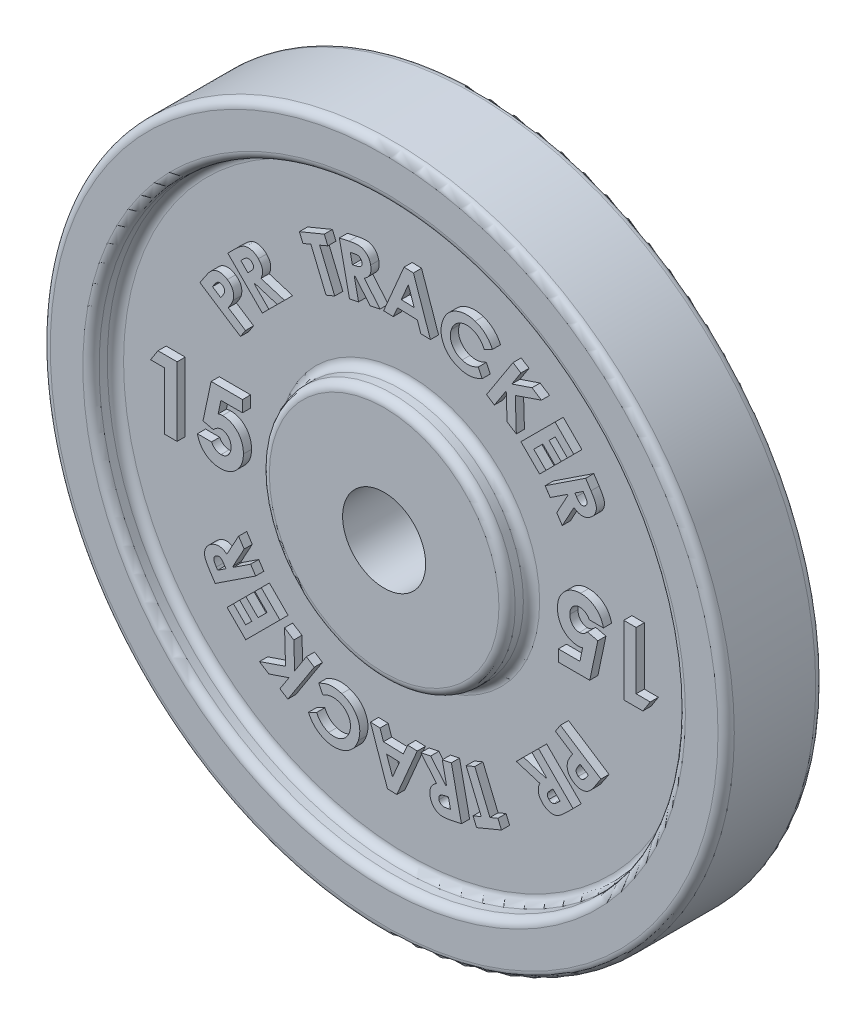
from build123d import *

# Parameters (mm, degrees)
ESBO_O1_R                = 21
ESBO_O1_R_2              = 2.55
RESSALTO_EXTRUS_O1_DEPTH = 6
ESBO_O2_R                = 18
ESBO_O2_R_2              = 7.55
CORTE_EXTRUS_O1_DEPTH    = 1.5
FILETE1_R                = 0.5
RESSALTO_EXTRUS_O2_DEPTH = 0.5
RESSALTO_EXTRUS_O3_DEPTH = 0.5
PADR_OCIRCULAR1_COUNT    = 2
FILETE2_R                = 0.5
FILETE3_R                = 0.5
RESSALTO_EXTRUS_O4_DEPTH = 0.5
RESSALTO_EXTRUS_O5_DEPTH = 0.5
PADR_OCIRCULAR2_COUNT    = 2


with BuildPart() as part:
    # Esbo_o1 → Ressalto-extrus_o1 (new body)
    with BuildSketch(Plane.XY):
        Circle(ESBO_O1_R)
        Circle(ESBO_O1_R_2, mode=Mode.SUBTRACT)
    extrude(amount=RESSALTO_EXTRUS_O1_DEPTH)

    # Esbo_o2 → Corte-extrus_o1 (cut)
    with BuildSketch(Plane.XY.offset(6)):
        Circle(ESBO_O2_R)
        Circle(ESBO_O2_R_2, mode=Mode.SUBTRACT)
    corte_extrus_o1 = extrude(amount=-CORTE_EXTRUS_O1_DEPTH, mode=Mode.SUBTRACT)

    # Filete1
    filete1_edges = [part.edges().sort_by_distance(p)[0] for p in [
        (-7.55, 0, 6),
        (-18, 0, 4.5),
        (-7.55, 0, 4.5),
        (-18, 0, 6),
    ]]
    fillet(filete1_edges, radius=FILETE1_R)

    # Esbo_o3 → Ressalto-extrus_o2 (add)
    # profile 1 of 9: a face of its own
    with BuildSketch(Plane.XY.offset(4.5)):
        with BuildLine():
            Line((11.372106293, 8.482696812), (11.70263514, 7.980893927))
            add(Edge.make_bspline(
                [(11.70263514, 7.980893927), (11.724196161, 7.947521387), (11.76576219, 7.883184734), (11.823642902, 7.789141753), (11.873676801, 7.700688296), (11.916269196, 7.618168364), (11.9531268, 7.542072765), (11.980870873, 7.471076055), (12.003586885, 7.406664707), (12.021625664, 7.328534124), (12.03179376, 7.234371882), (12.026669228, 7.122080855), (12.001764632, 7.010507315), (11.967025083, 6.919591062), (11.931859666, 6.848115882), (11.899674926, 6.79663945), (11.864071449, 6.746943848), (11.824230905, 6.699405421), (11.780243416, 6.653640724), (11.732185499, 6.609991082), (11.680364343, 6.567911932), (11.642951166, 6.542901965), (11.623909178, 6.530172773)],
                knots=[0, 0, 0, 0, 1.424579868, 2.746350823, 3.958867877, 5.067175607, 6.076040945, 6.988342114, 7.799210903, 8.522229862, 9.85875015, 11.181925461, 12.534388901, 13.939130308, 14.6618638, 15.387446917, 16.113030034, 16.852417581, 17.609320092, 18.387197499, 19.179140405, 20, 20, 20, 20], degree=3))
            add(Edge.make_bspline(
                [(11.623909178, 6.530172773), (11.603651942, 6.517253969), (11.563893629, 6.491898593), (11.502471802, 6.459700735), (11.441435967, 6.4320533), (11.380132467, 6.410855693), (11.319315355, 6.393320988), (11.258225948, 6.382908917), (11.197384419, 6.37656645), (11.136436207, 6.37605724), (11.075684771, 6.380787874), (11.01502661, 6.391326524), (10.954290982, 6.40654737), (10.894169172, 6.429160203), (10.833127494, 6.454272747), (10.77304555, 6.486804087), (10.712688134, 6.523926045), (10.673802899, 6.552333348), (10.653957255, 6.566831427)],
                knots=[0, 0, 0, 0, 1.102086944, 2.163035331, 3.179481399, 4.173821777, 5.137300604, 6.080390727, 7.013391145, 7.941897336, 8.873265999, 9.805722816, 10.76445368, 11.741476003, 12.750579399, 13.790977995, 14.872593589, 16, 16, 16, 16], degree=3))
            Line((10.653957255, 6.566831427), (9.936409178, 5.250124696))
            Line((9.936409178, 5.250124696), (9.595663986, 5.766951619))
            Line((9.595663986, 5.766951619), (10.279558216, 7.020557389))
            Line((10.279558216, 7.020557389), (10.250712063, 7.065028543))
            Line((10.250712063, 7.065028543), (9.197827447, 6.370917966))
            Line((9.197827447, 6.370917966), (8.885928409, 6.843874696))
            Line((8.885928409, 6.843874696), (11.372106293, 8.482696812))
        make_face()
        with BuildLine():
            Line((10.712250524, 7.369115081), (10.810207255, 7.220076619))
            add(Edge.make_bspline(
                [(10.810207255, 7.220076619), (10.82222925, 7.201908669), (10.845308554, 7.167030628), (10.881668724, 7.119046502), (10.916195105, 7.076232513), (10.949997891, 7.039374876), (10.982453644, 7.008009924), (11.013544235, 6.981619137), (11.044400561, 6.961738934), (11.083194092, 6.942255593), (11.134321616, 6.929880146), (11.19829258, 6.932687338), (11.264419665, 6.953846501), (11.305669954, 6.978554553), (11.32763514, 6.991711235)],
                knots=[0, 0, 0, 0, 1.203101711, 2.309662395, 3.324143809, 4.240453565, 5.070005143, 5.816667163, 6.488851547, 7.092611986, 8.2090873, 9.349703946, 10.588755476, 12, 12, 12, 12], degree=3))
            add(Edge.make_bspline(
                [(11.32763514, 6.991711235), (11.340342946, 7.000767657), (11.365409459, 7.01863171), (11.397276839, 7.051005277), (11.422317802, 7.087453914), (11.441728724, 7.126408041), (11.454266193, 7.167891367), (11.460187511, 7.210446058), (11.460451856, 7.253814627), (11.452661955, 7.300191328), (11.434169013, 7.353004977), (11.403911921, 7.416123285), (11.360818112, 7.491805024), (11.326138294, 7.545387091), (11.307202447, 7.574643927)],
                knots=[0, 0, 0, 0, 0.842179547, 1.661223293, 2.4389524, 3.223208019, 4.003944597, 4.769372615, 5.537932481, 6.338747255, 7.29721474, 8.551489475, 10.117047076, 12, 12, 12, 12], degree=3))
            Line((11.307202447, 7.574643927), (11.221264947, 7.705052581))
            Line((11.221264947, 7.705052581), (10.712250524, 7.369115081))
        make_face(mode=Mode.SUBTRACT)
    # profile 2 of 9: a face of its own
    with BuildSketch(Plane.XY.offset(4.5)):
        Polygon((9.497131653, 10.539133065), (10.643766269, 9.392498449), (10.252540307, 9.001272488), (9.503141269, 9.750671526), (9.123333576, 9.370863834), (9.872732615, 8.621464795), (9.488718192, 8.237450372), (8.739319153, 8.986849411), (8.187035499, 8.434565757), (8.936434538, 7.685166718), (8.544006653, 7.292738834), (7.397372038, 8.439373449), align=None)
    # profile 3 of 9: a face of its own
    with BuildSketch(Plane.XY.offset(4.5)):
        Polygon((6.914354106, 12.404591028), (7.398128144, 12.092091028), (6.838632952, 11.227307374), (8.080219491, 11.650384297), (8.655940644, 11.277788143), (7.053176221, 10.72550449), (7.11507526, 8.709278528), (6.547767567, 9.075865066), (6.494281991, 10.69425449), (5.771926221, 9.578268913), (5.288152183, 9.890768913), align=None)
    # profile 4 of 9: a face of its own
    with BuildSketch(Plane.XY.offset(4.5)):
        with BuildLine():
            Line((5.643245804, 12.465489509), (5.14564965, 12.22750874))
            add(Edge.make_bspline(
                [(5.14564965, 12.22750874), (5.124240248, 12.270637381), (5.08238287, 12.354957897), (5.00706436, 12.470935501), (4.925885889, 12.576147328), (4.8364413, 12.668755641), (4.740854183, 12.750845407), (4.636864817, 12.819650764), (4.526124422, 12.877448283), (4.447693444, 12.906043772), (4.408269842, 12.920417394)],
                knots=[0, 0, 0, 0, 1.108720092, 2.167651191, 3.18060078, 4.166538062, 5.129360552, 6.078037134, 7.033918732, 8, 8, 8, 8], degree=3))
            add(Edge.make_bspline(
                [(4.408269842, 12.920417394), (4.374572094, 12.930426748), (4.308244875, 12.950128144), (4.20743273, 12.969055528), (4.107941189, 12.976362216), (4.009462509, 12.975892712), (3.912242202, 12.963380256), (3.815944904, 12.941789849), (3.72111022, 12.909667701), (3.628914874, 12.867530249), (3.540271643, 12.818525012), (3.458639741, 12.760702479), (3.383840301, 12.69679356), (3.317503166, 12.624839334), (3.257358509, 12.547286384), (3.205773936, 12.461756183), (3.160882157, 12.369669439), (3.137626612, 12.304480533), (3.125817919, 12.271378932)],
                knots=[0, 0, 0, 0, 1.052060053, 2.070767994, 3.063437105, 4.035120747, 5.014106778, 5.991861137, 6.985689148, 8.005720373, 9.023421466, 10.013478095, 10.995783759, 11.96331235, 12.938580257, 13.929127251, 14.948452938, 16, 16, 16, 16], degree=3))
            add(Edge.make_bspline(
                [(3.125817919, 12.271378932), (3.118498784, 12.247826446), (3.104097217, 12.201483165), (3.088054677, 12.131334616), (3.075938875, 12.062137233), (3.067945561, 11.993527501), (3.06487748, 11.925441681), (3.066897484, 11.858001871), (3.072609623, 11.791291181), (3.083667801, 11.725686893), (3.098584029, 11.661415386), (3.117746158, 11.598917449), (3.141327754, 11.538489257), (3.169232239, 11.47995944), (3.200812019, 11.422929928), (3.237072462, 11.368310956), (3.277089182, 11.31540859), (3.321216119, 11.264964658), (3.368772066, 11.216562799), (3.419521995, 11.171968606), (3.473001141, 11.130439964), (3.529513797, 11.092992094), (3.588517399, 11.057556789), (3.650877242, 11.026911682), (3.715625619, 10.998527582), (3.760506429, 10.983385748), (3.783269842, 10.975705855)],
                knots=[0, 0, 0, 0, 1.08983963, 2.1444336, 3.178001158, 4.193971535, 5.19552419, 6.187598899, 7.174443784, 8.152670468, 9.125633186, 10.089121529, 11.039541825, 11.990127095, 12.953371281, 13.918526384, 14.88546701, 15.883372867, 16.878918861, 17.882661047, 18.867398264, 19.869381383, 20.877721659, 21.907298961, 22.938588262, 24, 24, 24, 24], degree=3))
            add(Edge.make_bspline(
                [(3.783269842, 10.975705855), (3.82212513, 10.96407343), (3.898580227, 10.941184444), (4.015139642, 10.921347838), (4.130158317, 10.915055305), (4.225424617, 10.918680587), (4.301950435, 10.930417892), (4.362185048, 10.942341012), (4.425160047, 10.95866318), (4.490718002, 10.979184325), (4.558828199, 11.004016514), (4.62946354, 11.032959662), (4.703130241, 11.065380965), (4.752502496, 11.089513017), (4.777861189, 11.101907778)],
                knots=[0, 0, 0, 0, 1.412340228, 2.779045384, 4.10748043, 5.421237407, 6.091506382, 6.803337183, 7.560088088, 8.35707087, 9.196132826, 10.085318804, 11.016576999, 12, 12, 12, 12], degree=3))
            Line((4.777861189, 11.101907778), (5.020048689, 10.599503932))
            add(Edge.make_bspline(
                [(5.020048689, 10.599503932), (4.986137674, 10.582965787), (4.91971388, 10.550571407), (4.819970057, 10.508372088), (4.723678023, 10.470788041), (4.630302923, 10.438698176), (4.539814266, 10.412426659), (4.452316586, 10.390824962), (4.367745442, 10.376061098), (4.285510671, 10.365955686), (4.204189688, 10.362076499), (4.122362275, 10.362044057), (4.039098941, 10.366209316), (3.95461992, 10.375168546), (3.868879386, 10.389396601), (3.781937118, 10.407109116), (3.69381468, 10.430250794), (3.635166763, 10.448440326), (3.605385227, 10.457677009)],
                knots=[0, 0, 0, 0, 1.235616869, 2.420286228, 3.546204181, 4.621062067, 5.653067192, 6.631820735, 7.5714333, 8.463446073, 9.343896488, 10.236271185, 11.14293321, 12.073336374, 13.017223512, 13.98880256, 14.978709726, 16, 16, 16, 16], degree=3))
            add(Edge.make_bspline(
                [(3.605385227, 10.457677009), (3.551727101, 10.476565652), (3.446398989, 10.513643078), (3.297649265, 10.584292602), (3.161014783, 10.665870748), (3.035742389, 10.757492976), (2.922155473, 10.860013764), (2.820622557, 10.973645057), (2.731387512, 11.098072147), (2.654896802, 11.231948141), (2.591081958, 11.372150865), (2.543576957, 11.517568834), (2.51058845, 11.665663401), (2.494729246, 11.817233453), (2.49340558, 11.971430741), (2.508187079, 12.128829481), (2.538861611, 12.289174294), (2.570587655, 12.395221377), (2.586755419, 12.449263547)],
                knots=[0, 0, 0, 0, 1.087256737, 2.134228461, 3.142668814, 4.126448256, 5.097398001, 6.063225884, 7.034900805, 8.019872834, 9.007433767, 9.975333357, 10.94012752, 11.903376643, 12.884071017, 13.884292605, 14.921823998, 16, 16, 16, 16], degree=3))
            add(Edge.make_bspline(
                [(2.586755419, 12.449263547), (2.598710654, 12.484095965), (2.622351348, 12.552974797), (2.665512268, 12.65208616), (2.712703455, 12.746597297), (2.765297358, 12.83581344), (2.822358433, 12.920395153), (2.885131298, 12.999649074), (2.952295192, 13.074640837), (3.025439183, 13.143444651), (3.102079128, 13.208027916), (3.183365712, 13.26630797), (3.268736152, 13.318674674), (3.357150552, 13.366279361), (3.450083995, 13.4073008), (3.546606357, 13.442756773), (3.647299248, 13.471979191), (3.750740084, 13.496147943), (3.856160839, 13.5133832), (3.962121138, 13.524247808), (4.067899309, 13.528599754), (4.173333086, 13.525669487), (4.278030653, 13.51504725), (4.38247792, 13.499035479), (4.486764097, 13.475736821), (4.555235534, 13.454541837), (4.589760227, 13.443854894)],
                knots=[0, 0, 0, 0, 1.061962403, 2.099961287, 3.115586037, 4.107642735, 5.085323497, 6.056407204, 7.021973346, 7.986605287, 8.950665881, 9.911273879, 10.868678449, 11.838127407, 12.805645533, 13.796506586, 14.802219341, 15.828295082, 16.859046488, 17.881389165, 18.899230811, 19.910902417, 20.921170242, 21.932973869, 22.95776332, 24, 24, 24, 24], degree=3))
            add(Edge.make_bspline(
                [(4.589760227, 13.443854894), (4.618936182, 13.433780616), (4.676886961, 13.413770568), (4.761345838, 13.377748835), (4.843666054, 13.338236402), (4.923879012, 13.294368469), (5.001343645, 13.245522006), (5.076553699, 13.192561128), (5.149572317, 13.135420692), (5.219496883, 13.073515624), (5.286779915, 13.008408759), (5.349692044, 12.939580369), (5.409691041, 12.868696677), (5.464914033, 12.794246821), (5.515403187, 12.716290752), (5.562227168, 12.635625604), (5.605999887, 12.552367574), (5.630803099, 12.494512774), (5.643245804, 12.465489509)],
                knots=[0, 0, 0, 0, 0.998866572, 1.984000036, 2.970072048, 3.953860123, 4.941572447, 5.932833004, 6.93037271, 7.941144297, 8.954553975, 9.959547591, 10.958329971, 11.959530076, 12.957722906, 13.963113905, 14.978181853, 16, 16, 16, 16], degree=3))
        make_face()
    # profile 5 of 9: a face of its own
    with BuildSketch(Plane.XY.offset(4.5)):
        Polygon((0.221709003, 14.132780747), (0.798031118, 14.112949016), (1.841300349, 11.088910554), (1.251156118, 11.109343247), (1.039617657, 11.732540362), (-0.177329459, 11.775208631), (-0.442353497, 11.168838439), (-1.03309869, 11.189271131), align=None)
        Polygon((0.48613208, 13.331098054), (0.05283881, 12.320881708), (0.84550708, 12.293237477), align=None, mode=Mode.SUBTRACT)
    # profile 6 of 9: a face of its own
    with BuildSketch(Plane.XY.offset(4.5)):
        with BuildLine():
            Line((-3.748977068, 13.699248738), (-3.157630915, 13.825450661))
            add(Edge.make_bspline(
                [(-3.157630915, 13.825450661), (-3.11861599, 13.833511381), (-3.043380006, 13.849055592), (-2.934083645, 13.867484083), (-2.832907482, 13.882026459), (-2.739971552, 13.892808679), (-2.655085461, 13.897468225), (-2.578472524, 13.898277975), (-2.509931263, 13.895221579), (-2.448440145, 13.886614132), (-2.392018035, 13.873700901), (-2.338344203, 13.856855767), (-2.286494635, 13.835739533), (-2.236425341, 13.810444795), (-2.18841238, 13.780791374), (-2.141582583, 13.747562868), (-2.096919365, 13.709826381), (-2.054116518, 13.66827923), (-2.014059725, 13.623221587), (-1.976360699, 13.575329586), (-1.943582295, 13.523161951), (-1.91349983, 13.46837792), (-1.886135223, 13.410817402), (-1.863720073, 13.349652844), (-1.843355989, 13.285833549), (-1.833382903, 13.241604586), (-1.828303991, 13.219080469)],
                knots=[0, 0, 0, 0, 1.704973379, 3.287853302, 4.742851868, 6.079738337, 7.290568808, 8.379457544, 9.358207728, 10.223935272, 11.033000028, 11.832927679, 12.628986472, 13.426521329, 14.230847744, 15.042135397, 15.881916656, 16.730752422, 17.592991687, 18.460754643, 19.335982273, 20.226199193, 21.135209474, 22.060410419, 23.012241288, 24, 24, 24, 24], degree=3))
            add(Edge.make_bspline(
                [(-1.828303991, 13.219080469), (-1.823872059, 13.195484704), (-1.815156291, 13.14908165), (-1.806151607, 13.079895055), (-1.804393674, 13.012561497), (-1.805508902, 12.947236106), (-1.813270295, 12.884248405), (-1.824014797, 12.822858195), (-1.842141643, 12.764069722), (-1.863436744, 12.706792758), (-1.890100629, 12.651605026), (-1.922242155, 12.59876618), (-1.958776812, 12.547363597), (-2.001295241, 12.498744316), (-2.048305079, 12.451798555), (-2.100051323, 12.406492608), (-2.157370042, 12.363888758), (-2.198138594, 12.337636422), (-2.218928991, 12.324248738)],
                knots=[0, 0, 0, 0, 1.09581435, 2.155011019, 3.179669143, 4.167483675, 5.133737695, 6.073368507, 7.007780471, 7.936629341, 8.860786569, 9.800016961, 10.756576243, 11.735379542, 12.74392103, 13.787214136, 14.871564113, 16, 16, 16, 16], degree=3))
            Line((-2.218928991, 12.324248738), (-1.24957803, 11.169801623))
            Line((-1.24957803, 11.169801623), (-1.858352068, 11.040594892))
            Line((-1.858352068, 11.040594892), (-2.78082803, 12.140955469))
            Line((-2.78082803, 12.140955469), (-2.832510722, 12.130138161))
            Line((-2.832510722, 12.130138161), (-2.569289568, 10.889753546))
            Line((-2.569289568, 10.889753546), (-3.126981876, 10.770763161))
            Line((-3.126981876, 10.770763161), (-3.748977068, 13.699248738))
        make_face()
        with BuildLine():
            Line((-2.947895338, 12.673407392), (-2.77301553, 12.710066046))
            add(Edge.make_bspline(
                [(-2.77301553, 12.710066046), (-2.751752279, 12.714951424), (-2.710882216, 12.724341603), (-2.652449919, 12.739833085), (-2.599637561, 12.7564915), (-2.55256387, 12.774327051), (-2.511544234, 12.793726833), (-2.475741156, 12.813396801), (-2.445380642, 12.834177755), (-2.420718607, 12.857047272), (-2.400569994, 12.881222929), (-2.384681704, 12.907606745), (-2.372570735, 12.936138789), (-2.364310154, 12.966885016), (-2.3592735, 12.999749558), (-2.35908776, 13.034847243), (-2.361960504, 13.072080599), (-2.366720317, 13.097320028), (-2.369169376, 13.11030643)],
                knots=[0, 0, 0, 0, 1.598184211, 3.071867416, 4.427024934, 5.653385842, 6.756228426, 7.748257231, 8.643888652, 9.443485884, 10.204445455, 10.941834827, 11.691389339, 12.467479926, 13.268557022, 14.119810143, 15.03258895, 16, 16, 16, 16], degree=3))
            add(Edge.make_bspline(
                [(-2.369169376, 13.11030643), (-2.372857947, 13.125700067), (-2.380042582, 13.155683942), (-2.399338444, 13.197067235), (-2.423545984, 13.234165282), (-2.452965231, 13.266917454), (-2.487429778, 13.29339287), (-2.524430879, 13.316209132), (-2.56574844, 13.330438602), (-2.602384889, 13.339094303), (-2.634940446, 13.342056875), (-2.663868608, 13.342735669), (-2.696718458, 13.340386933), (-2.733862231, 13.337731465), (-2.774906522, 13.332025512), (-2.82036844, 13.324713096), (-2.869883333, 13.315816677), (-2.904241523, 13.308704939), (-2.922053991, 13.305017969)],
                knots=[0, 0, 0, 0, 1.131166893, 2.203297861, 3.249782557, 4.295873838, 5.337726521, 6.353877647, 7.393258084, 8.45137998, 9.042365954, 9.731131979, 10.521344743, 11.399396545, 12.397667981, 13.487316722, 14.697338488, 16, 16, 16, 16], degree=3))
            Line((-2.922053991, 13.305017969), (-3.075299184, 13.272566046))
            Line((-3.075299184, 13.272566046), (-2.947895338, 12.673407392))
        make_face(mode=Mode.SUBTRACT)
    # profile 7 of 9: a face of its own
    with BuildSketch(Plane.XY.offset(4.5)):
        Polygon((-6.202171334, 12.807926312), (-4.675128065, 13.440738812), (-4.459983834, 12.922109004), (-4.963589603, 12.712974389), (-4.033902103, 10.468984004), (-4.566954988, 10.24843112), (-5.496642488, 12.492421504), (-5.987027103, 12.289296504), align=None)
    # profile 8 of 9: a face of its own
    with BuildSketch(Plane.XY.offset(4.5)):
        with BuildLine():
            Line((-10.599505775, 9.467272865), (-10.169818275, 9.895758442))
            add(Edge.make_bspline(
                [(-10.169818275, 9.895758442), (-10.141316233, 9.923753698), (-10.086316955, 9.977775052), (-10.004693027, 10.053245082), (-9.927847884, 10.121209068), (-9.854635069, 10.179596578), (-9.786650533, 10.230950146), (-9.722492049, 10.272906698), (-9.66276536, 10.307043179), (-9.58963716, 10.341521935), (-9.498181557, 10.370464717), (-9.385940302, 10.386720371), (-9.270852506, 10.385232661), (-9.174136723, 10.36969788), (-9.097020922, 10.348445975), (-9.039330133, 10.327835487), (-8.983116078, 10.302648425), (-8.927889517, 10.272904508), (-8.874022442, 10.238562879), (-8.820893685, 10.200242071), (-8.769754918, 10.156522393), (-8.73697313, 10.125088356), (-8.720299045, 10.109099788)],
                knots=[0, 0, 0, 0, 1.421133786, 2.742306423, 3.954344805, 5.069496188, 6.072872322, 6.984049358, 7.794588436, 8.518273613, 9.856972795, 11.189283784, 12.536208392, 13.936227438, 14.660613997, 15.379652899, 16.113338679, 16.849856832, 17.609021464, 18.384434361, 19.178260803, 20, 20, 20, 20], degree=3))
            add(Edge.make_bspline(
                [(-8.720299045, 10.109099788), (-8.703367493, 10.091744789), (-8.670215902, 10.057764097), (-8.626574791, 10.003113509), (-8.587171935, 9.948329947), (-8.552602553, 9.892608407), (-8.524439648, 9.835297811), (-8.501444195, 9.777178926), (-8.483314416, 9.718356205), (-8.470503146, 9.658431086), (-8.463587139, 9.597468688), (-8.460710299, 9.53555021), (-8.464938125, 9.472467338), (-8.473067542, 9.408335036), (-8.487039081, 9.343233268), (-8.506670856, 9.277286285), (-8.530984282, 9.210072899), (-8.551304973, 9.165854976), (-8.561645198, 9.143354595)],
                knots=[0, 0, 0, 0, 1.103197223, 2.160034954, 3.179906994, 4.174678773, 5.141294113, 6.082891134, 7.017573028, 7.940524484, 8.868105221, 9.808155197, 10.758194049, 11.742332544, 12.749361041, 13.785374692, 14.873083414, 16, 16, 16, 16], degree=3))
            Line((-8.561645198, 9.143354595), (-7.116332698, 8.698643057))
            Line((-7.116332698, 8.698643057), (-7.558640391, 8.258138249))
            Line((-7.558640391, 8.258138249), (-8.934842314, 8.681816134))
            Line((-8.934842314, 8.681816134), (-8.972101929, 8.644556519))
            Line((-8.972101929, 8.644556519), (-8.074866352, 7.743715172))
            Line((-8.074866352, 7.743715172), (-8.479914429, 7.339869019))
            Line((-8.479914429, 7.339869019), (-10.599505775, 9.467272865))
        make_face()
        with BuildLine():
            Line((-9.365731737, 9.039388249), (-9.238928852, 9.165590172))
            add(Edge.make_bspline(
                [(-9.238928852, 9.165590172), (-9.223627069, 9.181339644), (-9.1941939, 9.211633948), (-9.153196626, 9.256307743), (-9.118169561, 9.299445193), (-9.087893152, 9.33978526), (-9.063884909, 9.378651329), (-9.04410206, 9.414677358), (-9.030162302, 9.448956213), (-9.018589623, 9.491275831), (-9.016852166, 9.544258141), (-9.031818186, 9.607060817), (-9.066072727, 9.668099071), (-9.098869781, 9.703716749), (-9.116332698, 9.722681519)],
                knots=[0, 0, 0, 0, 1.202674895, 2.313360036, 3.319177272, 4.245179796, 5.073189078, 5.819223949, 6.493567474, 7.094979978, 8.214892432, 9.353828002, 10.591035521, 12, 12, 12, 12], degree=3))
            add(Edge.make_bspline(
                [(-9.116332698, 9.722681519), (-9.127824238, 9.733508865), (-9.150421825, 9.754800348), (-9.189346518, 9.779172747), (-9.230006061, 9.797904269), (-9.272853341, 9.80847089), (-9.316140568, 9.812471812), (-9.359674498, 9.811300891), (-9.402203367, 9.800892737), (-9.43762212, 9.788141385), (-9.46625409, 9.772592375), (-9.490907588, 9.757895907), (-9.517199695, 9.737993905), (-9.546842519, 9.715441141), (-9.578406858, 9.688202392), (-9.612880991, 9.65736726), (-9.649898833, 9.622852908), (-9.674898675, 9.597956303), (-9.687847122, 9.585061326)],
                knots=[0, 0, 0, 0, 1.125004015, 2.212269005, 3.262387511, 4.310165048, 5.344972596, 6.361525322, 7.402641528, 8.457426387, 9.039724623, 9.726656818, 10.504926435, 11.391944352, 12.386519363, 13.4806323, 14.695115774, 16, 16, 16, 16], degree=3))
            Line((-9.687847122, 9.585061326), (-9.799025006, 9.474484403))
            Line((-9.799025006, 9.474484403), (-9.365731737, 9.039388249))
        make_face(mode=Mode.SUBTRACT)
    # profile 9 of 9: a face of its own
    with BuildSketch(Plane.XY.offset(4.5)):
        with BuildLine():
            Line((-12.308870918, 7.044325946), (-11.98134688, 7.546128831))
            add(Edge.make_bspline(
                [(-11.98134688, 7.546128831), (-11.959636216, 7.578665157), (-11.917812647, 7.641343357), (-11.855330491, 7.730623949), (-11.794968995, 7.811310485), (-11.735855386, 7.882605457), (-11.68030535, 7.94608901), (-11.626652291, 8.000619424), (-11.575068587, 8.046433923), (-11.52510025, 8.084536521), (-11.475246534, 8.115763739), (-11.425066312, 8.142230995), (-11.373249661, 8.163866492), (-11.320451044, 8.182383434), (-11.265729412, 8.194956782), (-11.210059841, 8.20521918), (-11.152905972, 8.209628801), (-11.074873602, 8.210581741), (-10.975389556, 8.200198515), (-10.856174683, 8.170027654), (-10.737536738, 8.119701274), (-10.662507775, 8.074349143), (-10.623774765, 8.050936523)],
                knots=[0, 0, 0, 0, 1.407136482, 2.710717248, 3.919990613, 5.030955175, 6.041784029, 6.953954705, 7.781053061, 8.521898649, 9.211703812, 9.895079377, 10.560316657, 11.230338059, 11.905032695, 12.577993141, 13.26504473, 13.964123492, 15.383954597, 16.848671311, 18.373155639, 20, 20, 20, 20], degree=3))
            add(Edge.make_bspline(
                [(-10.623774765, 8.050936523), (-10.602739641, 8.036594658), (-10.561692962, 8.0086088), (-10.504605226, 7.962631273), (-10.45359978, 7.913595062), (-10.406916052, 7.863064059), (-10.367281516, 7.808759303), (-10.331957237, 7.752813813), (-10.302615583, 7.694018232), (-10.279094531, 7.632979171), (-10.261259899, 7.570345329), (-10.247856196, 7.50671609), (-10.240040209, 7.441975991), (-10.237618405, 7.376441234), (-10.240851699, 7.310158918), (-10.248630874, 7.243056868), (-10.261786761, 7.174910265), (-10.274673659, 7.129776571), (-10.281226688, 7.106825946)],
                knots=[0, 0, 0, 0, 1.124608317, 2.194493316, 3.233698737, 4.248804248, 5.229486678, 6.199567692, 7.169325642, 8.127585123, 9.085599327, 10.043777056, 10.997776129, 11.963162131, 12.9377548, 13.92690783, 14.945826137, 16, 16, 16, 16], degree=3))
            add(Edge.make_bspline(
                [(-10.281226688, 7.106825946), (-10.286271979, 7.092141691), (-10.297181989, 7.060388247), (-10.318515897, 7.010437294), (-10.346025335, 6.954630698), (-10.378136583, 6.891893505), (-10.417824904, 6.823723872), (-10.461958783, 6.748474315), (-10.512639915, 6.667567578), (-10.548589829, 6.611791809), (-10.56728438, 6.582787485)],
                knots=[0, 0, 0, 0, 0.622537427, 1.346183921, 2.176173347, 3.117576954, 4.171813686, 5.338785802, 6.616124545, 8, 8, 8, 8], degree=3))
            Line((-10.56728438, 6.582787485), (-9.514399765, 5.896489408))
            Line((-9.514399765, 5.896489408), (-9.822693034, 5.423532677))
            Line((-9.822693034, 5.423532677), (-12.308870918, 7.044325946))
        make_face()
        with BuildLine():
            Line((-11.028822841, 6.883869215), (-10.930265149, 7.034710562))
            add(Edge.make_bspline(
                [(-10.930265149, 7.034710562), (-10.912702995, 7.062157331), (-10.880443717, 7.112573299), (-10.840977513, 7.184219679), (-10.811208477, 7.243531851), (-10.794506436, 7.294263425), (-10.787318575, 7.338945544), (-10.787502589, 7.380666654), (-10.793223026, 7.421802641), (-10.806926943, 7.461344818), (-10.825809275, 7.499358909), (-10.8519373, 7.534169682), (-10.883729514, 7.566495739), (-10.90929918, 7.583999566), (-10.922452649, 7.593003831)],
                knots=[0, 0, 0, 0, 1.82986352, 3.361209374, 4.594483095, 5.551825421, 6.349238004, 7.125730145, 7.888067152, 8.670975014, 9.466161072, 10.26293814, 11.106426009, 12, 12, 12, 12], degree=3))
            add(Edge.make_bspline(
                [(-10.922452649, 7.593003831), (-10.934309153, 7.600318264), (-10.957170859, 7.614421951), (-10.993212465, 7.630081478), (-11.028808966, 7.641335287), (-11.064689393, 7.646638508), (-11.100257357, 7.647302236), (-11.135694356, 7.643086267), (-11.17099314, 7.633435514), (-11.193419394, 7.622991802), (-11.204904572, 7.617643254)],
                knots=[0, 0, 0, 0, 1.120226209, 2.160019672, 3.154816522, 4.117323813, 5.068961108, 6.011122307, 6.981434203, 8, 8, 8, 8], degree=3))
            add(Edge.make_bspline(
                [(-11.204904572, 7.617643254), (-11.213847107, 7.612843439), (-11.232650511, 7.602750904), (-11.260106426, 7.582112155), (-11.288481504, 7.556232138), (-11.318961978, 7.525451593), (-11.349627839, 7.488436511), (-11.383023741, 7.447308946), (-11.416466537, 7.399919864), (-11.438948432, 7.366486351), (-11.450697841, 7.349013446)],
                knots=[0, 0, 0, 0, 0.661727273, 1.391409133, 2.234074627, 3.167977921, 4.216097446, 5.369899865, 6.625466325, 8, 8, 8, 8], degree=3))
            Line((-11.450697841, 7.349013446), (-11.537837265, 7.215599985))
            Line((-11.537837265, 7.215599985), (-11.028822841, 6.883869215))
        make_face(mode=Mode.SUBTRACT)
    ressalto_extrus_o2 = extrude(amount=RESSALTO_EXTRUS_O2_DEPTH)

    # Esbo_o5 → Ressalto-extrus_o3 (add)
    with BuildSketch(Plane.XY.offset(4.5)):
        Polygon((-14.886658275, 2.133333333), (-13.712145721, 2.133333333), (-13.712145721, -2.1), (-14.471974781, -2.1), (-14.471974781, 1.427777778), (-15.34035085, 1.427777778), align=None)
        with BuildLine():
            Line((-11.62346383, 2.133333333), (-9.695906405, 2.133333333))
            Line((-9.695906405, 2.133333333), (-9.695906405, 1.427777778))
            Line((-9.695906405, 1.427777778), (-11.021367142, 1.427777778))
            Line((-11.021367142, 1.427777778), (-11.186731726, 0.62724359))
            add(Edge.make_bspline(
                [(-11.186731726, 0.62724359), (-11.164198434, 0.633519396), (-11.119758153, 0.645896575), (-11.052808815, 0.65830932), (-10.987925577, 0.666354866), (-10.945349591, 0.667428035), (-10.924692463, 0.667948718)],
                knots=[0, 0, 0, 0, 1.05461699, 2.079921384, 3.068411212, 4, 4, 4, 4], degree=3))
            add(Edge.make_bspline(
                [(-10.924692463, 0.667948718), (-10.879678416, 0.666917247), (-10.790945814, 0.664883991), (-10.661141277, 0.645581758), (-10.536845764, 0.615181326), (-10.418439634, 0.571824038), (-10.306038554, 0.515393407), (-10.199506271, 0.447128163), (-10.098712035, 0.366908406), (-10.005446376, 0.274683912), (-9.919749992, 0.173419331), (-9.845241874, 0.06389097), (-9.781607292, -0.052339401), (-9.730994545, -0.175994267), (-9.691046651, -0.306296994), (-9.66217941, -0.443331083), (-9.645108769, -0.587258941), (-9.642806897, -0.685450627), (-9.641632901, -0.735530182)],
                knots=[0, 0, 0, 0, 1.01440847, 1.999622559, 2.951875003, 3.895578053, 4.836219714, 5.782137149, 6.743708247, 7.735272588, 8.734977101, 9.730283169, 10.717124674, 11.717316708, 12.737475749, 13.78628267, 14.87096371, 16, 16, 16, 16], degree=3))
            add(Edge.make_bspline(
                [(-9.641632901, -0.735530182), (-9.643067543, -0.786178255), (-9.645898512, -0.886121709), (-9.664367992, -1.033073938), (-9.696966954, -1.173820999), (-9.741744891, -1.308739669), (-9.800736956, -1.436838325), (-9.871682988, -1.559443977), (-9.955782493, -1.675646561), (-10.052210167, -1.784254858), (-10.157039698, -1.883524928), (-10.268658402, -1.970852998), (-10.386282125, -2.044338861), (-10.509913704, -2.103727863), (-10.638843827, -2.150715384), (-10.773111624, -2.184920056), (-10.91336962, -2.204534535), (-11.008586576, -2.20719482), (-11.05698413, -2.208547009)],
                knots=[0, 0, 0, 0, 1.06808661, 2.107647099, 3.116961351, 4.110378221, 5.100014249, 6.085620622, 7.093190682, 8.119403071, 9.144090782, 10.133780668, 11.103064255, 12.062861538, 13.020824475, 13.992378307, 14.979551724, 16, 16, 16, 16], degree=3))
            add(Edge.make_bspline(
                [(-11.05698413, -2.208547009), (-11.100264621, -2.207440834), (-11.185622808, -2.205259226), (-11.311351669, -2.191849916), (-11.432568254, -2.16814213), (-11.548629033, -2.133830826), (-11.660755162, -2.091601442), (-11.767650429, -2.038785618), (-11.869902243, -1.976389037), (-11.967220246, -1.905550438), (-12.058023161, -1.825753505), (-12.140898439, -1.738402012), (-12.216347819, -1.644596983), (-12.282756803, -1.54318115), (-12.339917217, -1.434304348), (-12.390608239, -1.319249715), (-12.432099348, -1.196815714), (-12.45315489, -1.111937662), (-12.463855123, -1.068803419)],
                knots=[0, 0, 0, 0, 1.054957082, 2.080596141, 3.077793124, 4.061112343, 5.027190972, 5.994718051, 6.962465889, 7.943658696, 8.924948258, 9.904494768, 10.875059, 11.855380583, 12.854004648, 13.869083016, 14.917087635, 16, 16, 16, 16], degree=3))
            Line((-12.463855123, -1.068803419), (-11.595479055, -1.068803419))
            add(Edge.make_bspline(
                [(-11.595479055, -1.068803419), (-11.579605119, -1.098693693), (-11.548755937, -1.15678203), (-11.490073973, -1.233903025), (-11.424383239, -1.299668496), (-11.352276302, -1.354720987), (-11.273285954, -1.395965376), (-11.190630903, -1.427243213), (-11.103272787, -1.445317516), (-11.043778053, -1.447576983), (-11.013734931, -1.448717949)],
                knots=[0, 0, 0, 0, 1.104910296, 2.147267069, 3.153527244, 4.136738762, 5.099945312, 6.05603338, 7.018353, 8, 8, 8, 8], degree=3))
            add(Edge.make_bspline(
                [(-11.013734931, -1.448717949), (-10.992795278, -1.447930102), (-10.951596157, -1.44638), (-10.890895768, -1.438179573), (-10.832954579, -1.42264815), (-10.777341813, -1.40114074), (-10.723908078, -1.374318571), (-10.673419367, -1.340457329), (-10.624997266, -1.301481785), (-10.579378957, -1.256757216), (-10.538061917, -1.206899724), (-10.501831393, -1.153324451), (-10.469436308, -1.09722185), (-10.445440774, -1.036369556), (-10.42579046, -0.972584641), (-10.411319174, -0.905385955), (-10.402670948, -0.834695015), (-10.401870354, -0.786436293), (-10.401461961, -0.76181891)],
                knots=[0, 0, 0, 0, 0.978869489, 1.925942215, 2.855067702, 3.774946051, 4.70828698, 5.642468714, 6.60995405, 7.609372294, 8.622401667, 9.629904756, 10.629323, 11.642352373, 12.678539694, 13.745912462, 14.850161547, 16, 16, 16, 16], degree=3))
            add(Edge.make_bspline(
                [(-10.401461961, -0.76181891), (-10.401935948, -0.737772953), (-10.402858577, -0.690966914), (-10.410490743, -0.622238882), (-10.424144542, -0.557028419), (-10.442747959, -0.494836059), (-10.466562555, -0.436039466), (-10.495665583, -0.380288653), (-10.530181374, -0.327865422), (-10.570295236, -0.279837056), (-10.613072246, -0.235784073), (-10.6590285, -0.197255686), (-10.707749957, -0.165279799), (-10.757722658, -0.13736392), (-10.810941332, -0.117047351), (-10.866209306, -0.10305608), (-10.923468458, -0.092789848), (-10.962523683, -0.092186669), (-10.982358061, -0.091880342)],
                knots=[0, 0, 0, 0, 1.166249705, 2.270133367, 3.348514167, 4.393962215, 5.415026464, 6.420877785, 7.440098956, 8.453121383, 9.451844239, 10.415694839, 11.355045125, 12.27538808, 13.187007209, 14.108269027, 15.039275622, 16, 16, 16, 16], degree=3))
            add(Edge.make_bspline(
                [(-10.982358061, -0.091880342), (-11.003902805, -0.092697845), (-11.047083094, -0.094336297), (-11.111238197, -0.107667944), (-11.174619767, -0.12924355), (-11.237580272, -0.159010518), (-11.299494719, -0.197966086), (-11.361997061, -0.243656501), (-11.422995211, -0.299401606), (-11.461779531, -0.340920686), (-11.481843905, -0.36239984)],
                knots=[0, 0, 0, 0, 0.88288272, 1.769486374, 2.674910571, 3.623812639, 4.617874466, 5.670434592, 6.794841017, 8, 8, 8, 8], degree=3))
            Line((-11.481843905, -0.36239984), (-12.121253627, -0.215691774))
            Line((-12.121253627, -0.215691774), (-11.62346383, 2.133333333))
        make_face()
    ressalto_extrus_o3 = extrude(amount=RESSALTO_EXTRUS_O3_DEPTH)

    # Padr_oCircular1: Ressalto-extrus_o2, Ressalto-extrus_o3 ×2 about axis
    padr_ocircular1_axis = Axis((0, 0, 6), (0, 0, 1))
    add([ressalto_extrus_o2.rotate(padr_ocircular1_axis, i * 360 / PADR_OCIRCULAR1_COUNT) for i in range(1, PADR_OCIRCULAR1_COUNT)])
    add([ressalto_extrus_o3.rotate(padr_ocircular1_axis, i * 360 / PADR_OCIRCULAR1_COUNT) for i in range(1, PADR_OCIRCULAR1_COUNT)])

    # Filete2
    filete2_edges = [part.edges().sort_by_distance(p)[0] for p in [
        (-21, 0, 0),
        (-21, 0, 6),
    ]]
    fillet(filete2_edges, radius=FILETE2_R)

    # Espelhar6: Corte-extrus_o1 across plane
    add(corte_extrus_o1.mirror(Plane.XY.offset(3)), mode=Mode.SUBTRACT)

    # Filete3
    filete3_edges = [part.edges().sort_by_distance(p)[0] for p in [
        (-7.55, 0, 1.5),
        (-18, 0, 0),
        (-18, 0, 1.5),
        (-7.55, 0, 0),
    ]]
    fillet(filete3_edges, radius=FILETE3_R)

    # Esbo_o10 → Ressalto-extrus_o4 (add)
    # profile 1 of 9: a face of its own
    with BuildSketch(Plane(origin=(0, 0, 1.5), x_dir=(-1, 0, 0), z_dir=(0, 0, -1))):
        with BuildLine():
            Line((11.372106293, 8.482696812), (11.70263514, 7.980893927))
            add(Edge.make_bspline(
                [(11.70263514, 7.980893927), (11.724196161, 7.947521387), (11.76576219, 7.883184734), (11.823642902, 7.789141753), (11.873676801, 7.700688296), (11.916269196, 7.618168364), (11.9531268, 7.542072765), (11.980870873, 7.471076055), (12.003586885, 7.406664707), (12.021625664, 7.328534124), (12.03179376, 7.234371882), (12.026669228, 7.122080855), (12.001764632, 7.010507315), (11.967025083, 6.919591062), (11.931859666, 6.848115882), (11.899674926, 6.79663945), (11.864071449, 6.746943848), (11.824230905, 6.699405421), (11.780243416, 6.653640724), (11.732185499, 6.609991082), (11.680364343, 6.567911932), (11.642951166, 6.542901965), (11.623909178, 6.530172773)],
                knots=[0, 0, 0, 0, 1.424579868, 2.746350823, 3.958867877, 5.067175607, 6.076040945, 6.988342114, 7.799210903, 8.522229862, 9.85875015, 11.181925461, 12.534388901, 13.939130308, 14.6618638, 15.387446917, 16.113030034, 16.852417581, 17.609320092, 18.387197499, 19.179140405, 20, 20, 20, 20], degree=3))
            add(Edge.make_bspline(
                [(11.623909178, 6.530172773), (11.603651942, 6.517253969), (11.563893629, 6.491898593), (11.502471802, 6.459700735), (11.441435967, 6.4320533), (11.380132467, 6.410855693), (11.319315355, 6.393320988), (11.258225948, 6.382908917), (11.197384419, 6.37656645), (11.136436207, 6.37605724), (11.075684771, 6.380787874), (11.01502661, 6.391326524), (10.954290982, 6.40654737), (10.894169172, 6.429160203), (10.833127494, 6.454272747), (10.77304555, 6.486804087), (10.712688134, 6.523926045), (10.673802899, 6.552333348), (10.653957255, 6.566831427)],
                knots=[0, 0, 0, 0, 1.102086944, 2.163035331, 3.179481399, 4.173821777, 5.137300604, 6.080390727, 7.013391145, 7.941897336, 8.873265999, 9.805722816, 10.76445368, 11.741476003, 12.750579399, 13.790977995, 14.872593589, 16, 16, 16, 16], degree=3))
            Line((10.653957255, 6.566831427), (9.936409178, 5.250124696))
            Line((9.936409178, 5.250124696), (9.595663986, 5.766951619))
            Line((9.595663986, 5.766951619), (10.279558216, 7.020557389))
            Line((10.279558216, 7.020557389), (10.250712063, 7.065028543))
            Line((10.250712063, 7.065028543), (9.197827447, 6.370917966))
            Line((9.197827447, 6.370917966), (8.885928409, 6.843874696))
            Line((8.885928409, 6.843874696), (11.372106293, 8.482696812))
        make_face()
        with BuildLine():
            Line((10.712250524, 7.369115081), (10.810207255, 7.220076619))
            add(Edge.make_bspline(
                [(10.810207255, 7.220076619), (10.82222925, 7.201908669), (10.845308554, 7.167030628), (10.881668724, 7.119046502), (10.916195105, 7.076232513), (10.949997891, 7.039374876), (10.982453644, 7.008009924), (11.013544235, 6.981619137), (11.044400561, 6.961738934), (11.083194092, 6.942255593), (11.134321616, 6.929880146), (11.19829258, 6.932687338), (11.264419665, 6.953846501), (11.305669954, 6.978554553), (11.32763514, 6.991711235)],
                knots=[0, 0, 0, 0, 1.203101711, 2.309662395, 3.324143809, 4.240453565, 5.070005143, 5.816667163, 6.488851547, 7.092611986, 8.2090873, 9.349703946, 10.588755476, 12, 12, 12, 12], degree=3))
            add(Edge.make_bspline(
                [(11.32763514, 6.991711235), (11.340342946, 7.000767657), (11.365409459, 7.01863171), (11.397276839, 7.051005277), (11.422317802, 7.087453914), (11.441728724, 7.126408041), (11.454266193, 7.167891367), (11.460187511, 7.210446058), (11.460451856, 7.253814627), (11.452661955, 7.300191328), (11.434169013, 7.353004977), (11.403911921, 7.416123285), (11.360818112, 7.491805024), (11.326138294, 7.545387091), (11.307202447, 7.574643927)],
                knots=[0, 0, 0, 0, 0.842179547, 1.661223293, 2.4389524, 3.223208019, 4.003944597, 4.769372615, 5.537932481, 6.338747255, 7.29721474, 8.551489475, 10.117047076, 12, 12, 12, 12], degree=3))
            Line((11.307202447, 7.574643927), (11.221264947, 7.705052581))
            Line((11.221264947, 7.705052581), (10.712250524, 7.369115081))
        make_face(mode=Mode.SUBTRACT)
    # profile 2 of 9: a face of its own
    with BuildSketch(Plane(origin=(0, 0, 1.5), x_dir=(-1, 0, 0), z_dir=(0, 0, -1))):
        Polygon((9.497131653, 10.539133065), (10.643766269, 9.392498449), (10.252540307, 9.001272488), (9.503141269, 9.750671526), (9.123333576, 9.370863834), (9.872732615, 8.621464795), (9.488718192, 8.237450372), (8.739319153, 8.986849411), (8.187035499, 8.434565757), (8.936434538, 7.685166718), (8.544006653, 7.292738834), (7.397372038, 8.439373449), align=None)
    # profile 3 of 9: a face of its own
    with BuildSketch(Plane(origin=(0, 0, 1.5), x_dir=(-1, 0, 0), z_dir=(0, 0, -1))):
        Polygon((6.914354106, 12.404591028), (7.398128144, 12.092091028), (6.838632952, 11.227307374), (8.080219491, 11.650384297), (8.655940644, 11.277788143), (7.053176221, 10.72550449), (7.11507526, 8.709278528), (6.547767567, 9.075865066), (6.494281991, 10.69425449), (5.771926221, 9.578268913), (5.288152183, 9.890768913), align=None)
    # profile 4 of 9: a face of its own
    with BuildSketch(Plane(origin=(0, 0, 1.5), x_dir=(-1, 0, 0), z_dir=(0, 0, -1))):
        with BuildLine():
            Line((5.643245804, 12.465489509), (5.14564965, 12.22750874))
            add(Edge.make_bspline(
                [(5.14564965, 12.22750874), (5.124240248, 12.270637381), (5.08238287, 12.354957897), (5.00706436, 12.470935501), (4.925885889, 12.576147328), (4.8364413, 12.668755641), (4.740854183, 12.750845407), (4.636864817, 12.819650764), (4.526124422, 12.877448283), (4.447693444, 12.906043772), (4.408269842, 12.920417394)],
                knots=[0, 0, 0, 0, 1.108720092, 2.167651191, 3.18060078, 4.166538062, 5.129360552, 6.078037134, 7.033918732, 8, 8, 8, 8], degree=3))
            add(Edge.make_bspline(
                [(4.408269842, 12.920417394), (4.374572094, 12.930426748), (4.308244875, 12.950128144), (4.20743273, 12.969055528), (4.107941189, 12.976362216), (4.009462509, 12.975892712), (3.912242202, 12.963380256), (3.815944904, 12.941789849), (3.72111022, 12.909667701), (3.628914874, 12.867530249), (3.540271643, 12.818525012), (3.458639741, 12.760702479), (3.383840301, 12.69679356), (3.317503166, 12.624839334), (3.257358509, 12.547286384), (3.205773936, 12.461756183), (3.160882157, 12.369669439), (3.137626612, 12.304480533), (3.125817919, 12.271378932)],
                knots=[0, 0, 0, 0, 1.052060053, 2.070767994, 3.063437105, 4.035120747, 5.014106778, 5.991861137, 6.985689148, 8.005720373, 9.023421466, 10.013478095, 10.995783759, 11.96331235, 12.938580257, 13.929127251, 14.948452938, 16, 16, 16, 16], degree=3))
            add(Edge.make_bspline(
                [(3.125817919, 12.271378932), (3.118498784, 12.247826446), (3.104097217, 12.201483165), (3.088054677, 12.131334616), (3.075938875, 12.062137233), (3.067945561, 11.993527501), (3.06487748, 11.925441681), (3.066897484, 11.858001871), (3.072609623, 11.791291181), (3.083667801, 11.725686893), (3.098584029, 11.661415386), (3.117746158, 11.598917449), (3.141327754, 11.538489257), (3.169232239, 11.47995944), (3.200812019, 11.422929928), (3.237072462, 11.368310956), (3.277089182, 11.31540859), (3.321216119, 11.264964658), (3.368772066, 11.216562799), (3.419521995, 11.171968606), (3.473001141, 11.130439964), (3.529513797, 11.092992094), (3.588517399, 11.057556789), (3.650877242, 11.026911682), (3.715625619, 10.998527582), (3.760506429, 10.983385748), (3.783269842, 10.975705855)],
                knots=[0, 0, 0, 0, 1.08983963, 2.1444336, 3.178001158, 4.193971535, 5.19552419, 6.187598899, 7.174443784, 8.152670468, 9.125633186, 10.089121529, 11.039541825, 11.990127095, 12.953371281, 13.918526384, 14.88546701, 15.883372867, 16.878918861, 17.882661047, 18.867398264, 19.869381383, 20.877721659, 21.907298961, 22.938588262, 24, 24, 24, 24], degree=3))
            add(Edge.make_bspline(
                [(3.783269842, 10.975705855), (3.82212513, 10.96407343), (3.898580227, 10.941184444), (4.015139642, 10.921347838), (4.130158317, 10.915055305), (4.225424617, 10.918680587), (4.301950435, 10.930417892), (4.362185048, 10.942341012), (4.425160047, 10.95866318), (4.490718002, 10.979184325), (4.558828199, 11.004016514), (4.62946354, 11.032959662), (4.703130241, 11.065380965), (4.752502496, 11.089513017), (4.777861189, 11.101907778)],
                knots=[0, 0, 0, 0, 1.412340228, 2.779045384, 4.10748043, 5.421237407, 6.091506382, 6.803337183, 7.560088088, 8.35707087, 9.196132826, 10.085318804, 11.016576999, 12, 12, 12, 12], degree=3))
            Line((4.777861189, 11.101907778), (5.020048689, 10.599503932))
            add(Edge.make_bspline(
                [(5.020048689, 10.599503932), (4.986137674, 10.582965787), (4.91971388, 10.550571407), (4.819970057, 10.508372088), (4.723678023, 10.470788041), (4.630302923, 10.438698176), (4.539814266, 10.412426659), (4.452316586, 10.390824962), (4.367745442, 10.376061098), (4.285510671, 10.365955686), (4.204189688, 10.362076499), (4.122362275, 10.362044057), (4.039098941, 10.366209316), (3.95461992, 10.375168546), (3.868879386, 10.389396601), (3.781937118, 10.407109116), (3.69381468, 10.430250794), (3.635166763, 10.448440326), (3.605385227, 10.457677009)],
                knots=[0, 0, 0, 0, 1.235616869, 2.420286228, 3.546204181, 4.621062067, 5.653067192, 6.631820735, 7.5714333, 8.463446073, 9.343896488, 10.236271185, 11.14293321, 12.073336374, 13.017223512, 13.98880256, 14.978709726, 16, 16, 16, 16], degree=3))
            add(Edge.make_bspline(
                [(3.605385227, 10.457677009), (3.551727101, 10.476565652), (3.446398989, 10.513643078), (3.297649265, 10.584292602), (3.161014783, 10.665870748), (3.035742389, 10.757492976), (2.922155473, 10.860013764), (2.820622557, 10.973645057), (2.731387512, 11.098072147), (2.654896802, 11.231948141), (2.591081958, 11.372150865), (2.543576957, 11.517568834), (2.51058845, 11.665663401), (2.494729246, 11.817233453), (2.49340558, 11.971430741), (2.508187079, 12.128829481), (2.538861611, 12.289174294), (2.570587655, 12.395221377), (2.586755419, 12.449263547)],
                knots=[0, 0, 0, 0, 1.087256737, 2.134228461, 3.142668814, 4.126448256, 5.097398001, 6.063225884, 7.034900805, 8.019872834, 9.007433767, 9.975333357, 10.94012752, 11.903376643, 12.884071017, 13.884292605, 14.921823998, 16, 16, 16, 16], degree=3))
            add(Edge.make_bspline(
                [(2.586755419, 12.449263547), (2.598710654, 12.484095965), (2.622351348, 12.552974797), (2.665512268, 12.65208616), (2.712703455, 12.746597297), (2.765297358, 12.83581344), (2.822358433, 12.920395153), (2.885131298, 12.999649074), (2.952295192, 13.074640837), (3.025439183, 13.143444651), (3.102079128, 13.208027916), (3.183365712, 13.26630797), (3.268736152, 13.318674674), (3.357150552, 13.366279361), (3.450083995, 13.4073008), (3.546606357, 13.442756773), (3.647299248, 13.471979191), (3.750740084, 13.496147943), (3.856160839, 13.5133832), (3.962121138, 13.524247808), (4.067899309, 13.528599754), (4.173333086, 13.525669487), (4.278030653, 13.51504725), (4.38247792, 13.499035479), (4.486764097, 13.475736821), (4.555235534, 13.454541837), (4.589760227, 13.443854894)],
                knots=[0, 0, 0, 0, 1.061962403, 2.099961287, 3.115586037, 4.107642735, 5.085323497, 6.056407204, 7.021973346, 7.986605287, 8.950665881, 9.911273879, 10.868678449, 11.838127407, 12.805645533, 13.796506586, 14.802219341, 15.828295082, 16.859046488, 17.881389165, 18.899230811, 19.910902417, 20.921170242, 21.932973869, 22.95776332, 24, 24, 24, 24], degree=3))
            add(Edge.make_bspline(
                [(4.589760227, 13.443854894), (4.618936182, 13.433780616), (4.676886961, 13.413770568), (4.761345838, 13.377748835), (4.843666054, 13.338236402), (4.923879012, 13.294368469), (5.001343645, 13.245522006), (5.076553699, 13.192561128), (5.149572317, 13.135420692), (5.219496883, 13.073515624), (5.286779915, 13.008408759), (5.349692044, 12.939580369), (5.409691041, 12.868696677), (5.464914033, 12.794246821), (5.515403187, 12.716290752), (5.562227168, 12.635625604), (5.605999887, 12.552367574), (5.630803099, 12.494512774), (5.643245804, 12.465489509)],
                knots=[0, 0, 0, 0, 0.998866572, 1.984000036, 2.970072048, 3.953860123, 4.941572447, 5.932833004, 6.93037271, 7.941144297, 8.954553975, 9.959547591, 10.958329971, 11.959530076, 12.957722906, 13.963113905, 14.978181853, 16, 16, 16, 16], degree=3))
        make_face()
    # profile 5 of 9: a face of its own
    with BuildSketch(Plane(origin=(0, 0, 1.5), x_dir=(-1, 0, 0), z_dir=(0, 0, -1))):
        Polygon((0.221709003, 14.132780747), (0.798031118, 14.112949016), (1.841300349, 11.088910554), (1.251156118, 11.109343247), (1.039617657, 11.732540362), (-0.177329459, 11.775208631), (-0.442353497, 11.168838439), (-1.03309869, 11.189271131), align=None)
        Polygon((0.48613208, 13.331098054), (0.05283881, 12.320881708), (0.84550708, 12.293237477), align=None, mode=Mode.SUBTRACT)
    # profile 6 of 9: a face of its own
    with BuildSketch(Plane(origin=(0, 0, 1.5), x_dir=(-1, 0, 0), z_dir=(0, 0, -1))):
        with BuildLine():
            Line((-3.748977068, 13.699248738), (-3.157630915, 13.825450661))
            add(Edge.make_bspline(
                [(-3.157630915, 13.825450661), (-3.11861599, 13.833511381), (-3.043380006, 13.849055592), (-2.934083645, 13.867484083), (-2.832907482, 13.882026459), (-2.739971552, 13.892808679), (-2.655085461, 13.897468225), (-2.578472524, 13.898277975), (-2.509931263, 13.895221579), (-2.448440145, 13.886614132), (-2.392018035, 13.873700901), (-2.338344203, 13.856855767), (-2.286494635, 13.835739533), (-2.236425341, 13.810444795), (-2.18841238, 13.780791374), (-2.141582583, 13.747562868), (-2.096919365, 13.709826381), (-2.054116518, 13.66827923), (-2.014059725, 13.623221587), (-1.976360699, 13.575329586), (-1.943582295, 13.523161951), (-1.91349983, 13.46837792), (-1.886135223, 13.410817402), (-1.863720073, 13.349652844), (-1.843355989, 13.285833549), (-1.833382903, 13.241604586), (-1.828303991, 13.219080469)],
                knots=[0, 0, 0, 0, 1.704973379, 3.287853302, 4.742851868, 6.079738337, 7.290568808, 8.379457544, 9.358207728, 10.223935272, 11.033000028, 11.832927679, 12.628986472, 13.426521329, 14.230847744, 15.042135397, 15.881916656, 16.730752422, 17.592991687, 18.460754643, 19.335982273, 20.226199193, 21.135209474, 22.060410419, 23.012241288, 24, 24, 24, 24], degree=3))
            add(Edge.make_bspline(
                [(-1.828303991, 13.219080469), (-1.823872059, 13.195484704), (-1.815156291, 13.14908165), (-1.806151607, 13.079895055), (-1.804393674, 13.012561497), (-1.805508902, 12.947236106), (-1.813270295, 12.884248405), (-1.824014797, 12.822858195), (-1.842141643, 12.764069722), (-1.863436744, 12.706792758), (-1.890100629, 12.651605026), (-1.922242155, 12.59876618), (-1.958776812, 12.547363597), (-2.001295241, 12.498744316), (-2.048305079, 12.451798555), (-2.100051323, 12.406492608), (-2.157370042, 12.363888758), (-2.198138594, 12.337636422), (-2.218928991, 12.324248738)],
                knots=[0, 0, 0, 0, 1.09581435, 2.155011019, 3.179669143, 4.167483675, 5.133737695, 6.073368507, 7.007780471, 7.936629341, 8.860786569, 9.800016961, 10.756576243, 11.735379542, 12.74392103, 13.787214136, 14.871564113, 16, 16, 16, 16], degree=3))
            Line((-2.218928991, 12.324248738), (-1.24957803, 11.169801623))
            Line((-1.24957803, 11.169801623), (-1.858352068, 11.040594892))
            Line((-1.858352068, 11.040594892), (-2.78082803, 12.140955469))
            Line((-2.78082803, 12.140955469), (-2.832510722, 12.130138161))
            Line((-2.832510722, 12.130138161), (-2.569289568, 10.889753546))
            Line((-2.569289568, 10.889753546), (-3.126981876, 10.770763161))
            Line((-3.126981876, 10.770763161), (-3.748977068, 13.699248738))
        make_face()
        with BuildLine():
            Line((-2.947895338, 12.673407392), (-2.77301553, 12.710066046))
            add(Edge.make_bspline(
                [(-2.77301553, 12.710066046), (-2.751752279, 12.714951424), (-2.710882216, 12.724341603), (-2.652449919, 12.739833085), (-2.599637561, 12.7564915), (-2.55256387, 12.774327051), (-2.511544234, 12.793726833), (-2.475741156, 12.813396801), (-2.445380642, 12.834177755), (-2.420718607, 12.857047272), (-2.400569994, 12.881222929), (-2.384681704, 12.907606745), (-2.372570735, 12.936138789), (-2.364310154, 12.966885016), (-2.3592735, 12.999749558), (-2.35908776, 13.034847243), (-2.361960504, 13.072080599), (-2.366720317, 13.097320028), (-2.369169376, 13.11030643)],
                knots=[0, 0, 0, 0, 1.598184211, 3.071867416, 4.427024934, 5.653385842, 6.756228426, 7.748257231, 8.643888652, 9.443485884, 10.204445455, 10.941834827, 11.691389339, 12.467479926, 13.268557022, 14.119810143, 15.03258895, 16, 16, 16, 16], degree=3))
            add(Edge.make_bspline(
                [(-2.369169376, 13.11030643), (-2.372857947, 13.125700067), (-2.380042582, 13.155683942), (-2.399338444, 13.197067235), (-2.423545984, 13.234165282), (-2.452965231, 13.266917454), (-2.487429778, 13.29339287), (-2.524430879, 13.316209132), (-2.56574844, 13.330438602), (-2.602384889, 13.339094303), (-2.634940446, 13.342056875), (-2.663868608, 13.342735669), (-2.696718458, 13.340386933), (-2.733862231, 13.337731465), (-2.774906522, 13.332025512), (-2.82036844, 13.324713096), (-2.869883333, 13.315816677), (-2.904241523, 13.308704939), (-2.922053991, 13.305017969)],
                knots=[0, 0, 0, 0, 1.131166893, 2.203297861, 3.249782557, 4.295873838, 5.337726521, 6.353877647, 7.393258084, 8.45137998, 9.042365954, 9.731131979, 10.521344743, 11.399396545, 12.397667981, 13.487316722, 14.697338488, 16, 16, 16, 16], degree=3))
            Line((-2.922053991, 13.305017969), (-3.075299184, 13.272566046))
            Line((-3.075299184, 13.272566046), (-2.947895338, 12.673407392))
        make_face(mode=Mode.SUBTRACT)
    # profile 7 of 9: a face of its own
    with BuildSketch(Plane(origin=(0, 0, 1.5), x_dir=(-1, 0, 0), z_dir=(0, 0, -1))):
        Polygon((-6.202171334, 12.807926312), (-4.675128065, 13.440738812), (-4.459983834, 12.922109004), (-4.963589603, 12.712974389), (-4.033902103, 10.468984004), (-4.566954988, 10.24843112), (-5.496642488, 12.492421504), (-5.987027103, 12.289296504), align=None)
    # profile 8 of 9: a face of its own
    with BuildSketch(Plane(origin=(0, 0, 1.5), x_dir=(-1, 0, 0), z_dir=(0, 0, -1))):
        with BuildLine():
            Line((-10.599505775, 9.467272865), (-10.169818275, 9.895758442))
            add(Edge.make_bspline(
                [(-10.169818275, 9.895758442), (-10.141316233, 9.923753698), (-10.086316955, 9.977775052), (-10.004693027, 10.053245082), (-9.927847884, 10.121209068), (-9.854635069, 10.179596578), (-9.786650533, 10.230950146), (-9.722492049, 10.272906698), (-9.66276536, 10.307043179), (-9.58963716, 10.341521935), (-9.498181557, 10.370464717), (-9.385940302, 10.386720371), (-9.270852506, 10.385232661), (-9.174136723, 10.36969788), (-9.097020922, 10.348445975), (-9.039330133, 10.327835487), (-8.983116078, 10.302648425), (-8.927889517, 10.272904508), (-8.874022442, 10.238562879), (-8.820893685, 10.200242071), (-8.769754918, 10.156522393), (-8.73697313, 10.125088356), (-8.720299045, 10.109099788)],
                knots=[0, 0, 0, 0, 1.421133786, 2.742306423, 3.954344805, 5.069496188, 6.072872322, 6.984049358, 7.794588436, 8.518273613, 9.856972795, 11.189283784, 12.536208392, 13.936227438, 14.660613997, 15.379652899, 16.113338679, 16.849856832, 17.609021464, 18.384434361, 19.178260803, 20, 20, 20, 20], degree=3))
            add(Edge.make_bspline(
                [(-8.720299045, 10.109099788), (-8.703367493, 10.091744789), (-8.670215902, 10.057764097), (-8.626574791, 10.003113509), (-8.587171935, 9.948329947), (-8.552602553, 9.892608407), (-8.524439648, 9.835297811), (-8.501444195, 9.777178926), (-8.483314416, 9.718356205), (-8.470503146, 9.658431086), (-8.463587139, 9.597468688), (-8.460710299, 9.53555021), (-8.464938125, 9.472467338), (-8.473067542, 9.408335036), (-8.487039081, 9.343233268), (-8.506670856, 9.277286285), (-8.530984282, 9.210072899), (-8.551304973, 9.165854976), (-8.561645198, 9.143354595)],
                knots=[0, 0, 0, 0, 1.103197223, 2.160034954, 3.179906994, 4.174678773, 5.141294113, 6.082891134, 7.017573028, 7.940524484, 8.868105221, 9.808155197, 10.758194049, 11.742332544, 12.749361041, 13.785374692, 14.873083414, 16, 16, 16, 16], degree=3))
            Line((-8.561645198, 9.143354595), (-7.116332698, 8.698643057))
            Line((-7.116332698, 8.698643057), (-7.558640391, 8.258138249))
            Line((-7.558640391, 8.258138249), (-8.934842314, 8.681816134))
            Line((-8.934842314, 8.681816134), (-8.972101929, 8.644556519))
            Line((-8.972101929, 8.644556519), (-8.074866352, 7.743715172))
            Line((-8.074866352, 7.743715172), (-8.479914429, 7.339869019))
            Line((-8.479914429, 7.339869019), (-10.599505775, 9.467272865))
        make_face()
        with BuildLine():
            Line((-9.365731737, 9.039388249), (-9.238928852, 9.165590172))
            add(Edge.make_bspline(
                [(-9.238928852, 9.165590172), (-9.223627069, 9.181339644), (-9.1941939, 9.211633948), (-9.153196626, 9.256307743), (-9.118169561, 9.299445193), (-9.087893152, 9.33978526), (-9.063884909, 9.378651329), (-9.04410206, 9.414677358), (-9.030162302, 9.448956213), (-9.018589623, 9.491275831), (-9.016852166, 9.544258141), (-9.031818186, 9.607060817), (-9.066072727, 9.668099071), (-9.098869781, 9.703716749), (-9.116332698, 9.722681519)],
                knots=[0, 0, 0, 0, 1.202674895, 2.313360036, 3.319177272, 4.245179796, 5.073189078, 5.819223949, 6.493567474, 7.094979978, 8.214892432, 9.353828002, 10.591035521, 12, 12, 12, 12], degree=3))
            add(Edge.make_bspline(
                [(-9.116332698, 9.722681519), (-9.127824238, 9.733508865), (-9.150421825, 9.754800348), (-9.189346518, 9.779172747), (-9.230006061, 9.797904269), (-9.272853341, 9.80847089), (-9.316140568, 9.812471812), (-9.359674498, 9.811300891), (-9.402203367, 9.800892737), (-9.43762212, 9.788141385), (-9.46625409, 9.772592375), (-9.490907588, 9.757895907), (-9.517199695, 9.737993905), (-9.546842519, 9.715441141), (-9.578406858, 9.688202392), (-9.612880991, 9.65736726), (-9.649898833, 9.622852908), (-9.674898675, 9.597956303), (-9.687847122, 9.585061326)],
                knots=[0, 0, 0, 0, 1.125004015, 2.212269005, 3.262387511, 4.310165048, 5.344972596, 6.361525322, 7.402641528, 8.457426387, 9.039724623, 9.726656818, 10.504926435, 11.391944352, 12.386519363, 13.4806323, 14.695115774, 16, 16, 16, 16], degree=3))
            Line((-9.687847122, 9.585061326), (-9.799025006, 9.474484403))
            Line((-9.799025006, 9.474484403), (-9.365731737, 9.039388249))
        make_face(mode=Mode.SUBTRACT)
    # profile 9 of 9: a face of its own
    with BuildSketch(Plane(origin=(0, 0, 1.5), x_dir=(-1, 0, 0), z_dir=(0, 0, -1))):
        with BuildLine():
            Line((-12.308870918, 7.044325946), (-11.98134688, 7.546128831))
            add(Edge.make_bspline(
                [(-11.98134688, 7.546128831), (-11.959636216, 7.578665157), (-11.917812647, 7.641343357), (-11.855330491, 7.730623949), (-11.794968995, 7.811310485), (-11.735855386, 7.882605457), (-11.68030535, 7.94608901), (-11.626652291, 8.000619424), (-11.575068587, 8.046433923), (-11.52510025, 8.084536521), (-11.475246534, 8.115763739), (-11.425066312, 8.142230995), (-11.373249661, 8.163866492), (-11.320451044, 8.182383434), (-11.265729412, 8.194956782), (-11.210059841, 8.20521918), (-11.152905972, 8.209628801), (-11.074873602, 8.210581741), (-10.975389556, 8.200198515), (-10.856174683, 8.170027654), (-10.737536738, 8.119701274), (-10.662507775, 8.074349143), (-10.623774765, 8.050936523)],
                knots=[0, 0, 0, 0, 1.407136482, 2.710717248, 3.919990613, 5.030955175, 6.041784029, 6.953954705, 7.781053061, 8.521898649, 9.211703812, 9.895079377, 10.560316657, 11.230338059, 11.905032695, 12.577993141, 13.26504473, 13.964123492, 15.383954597, 16.848671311, 18.373155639, 20, 20, 20, 20], degree=3))
            add(Edge.make_bspline(
                [(-10.623774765, 8.050936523), (-10.602739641, 8.036594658), (-10.561692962, 8.0086088), (-10.504605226, 7.962631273), (-10.45359978, 7.913595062), (-10.406916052, 7.863064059), (-10.367281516, 7.808759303), (-10.331957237, 7.752813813), (-10.302615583, 7.694018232), (-10.279094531, 7.632979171), (-10.261259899, 7.570345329), (-10.247856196, 7.50671609), (-10.240040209, 7.441975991), (-10.237618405, 7.376441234), (-10.240851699, 7.310158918), (-10.248630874, 7.243056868), (-10.261786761, 7.174910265), (-10.274673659, 7.129776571), (-10.281226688, 7.106825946)],
                knots=[0, 0, 0, 0, 1.124608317, 2.194493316, 3.233698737, 4.248804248, 5.229486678, 6.199567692, 7.169325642, 8.127585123, 9.085599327, 10.043777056, 10.997776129, 11.963162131, 12.9377548, 13.92690783, 14.945826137, 16, 16, 16, 16], degree=3))
            add(Edge.make_bspline(
                [(-10.281226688, 7.106825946), (-10.286271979, 7.092141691), (-10.297181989, 7.060388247), (-10.318515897, 7.010437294), (-10.346025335, 6.954630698), (-10.378136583, 6.891893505), (-10.417824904, 6.823723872), (-10.461958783, 6.748474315), (-10.512639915, 6.667567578), (-10.548589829, 6.611791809), (-10.56728438, 6.582787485)],
                knots=[0, 0, 0, 0, 0.622537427, 1.346183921, 2.176173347, 3.117576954, 4.171813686, 5.338785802, 6.616124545, 8, 8, 8, 8], degree=3))
            Line((-10.56728438, 6.582787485), (-9.514399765, 5.896489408))
            Line((-9.514399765, 5.896489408), (-9.822693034, 5.423532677))
            Line((-9.822693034, 5.423532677), (-12.308870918, 7.044325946))
        make_face()
        with BuildLine():
            Line((-11.028822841, 6.883869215), (-10.930265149, 7.034710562))
            add(Edge.make_bspline(
                [(-10.930265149, 7.034710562), (-10.912702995, 7.062157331), (-10.880443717, 7.112573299), (-10.840977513, 7.184219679), (-10.811208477, 7.243531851), (-10.794506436, 7.294263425), (-10.787318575, 7.338945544), (-10.787502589, 7.380666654), (-10.793223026, 7.421802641), (-10.806926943, 7.461344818), (-10.825809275, 7.499358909), (-10.8519373, 7.534169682), (-10.883729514, 7.566495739), (-10.90929918, 7.583999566), (-10.922452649, 7.593003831)],
                knots=[0, 0, 0, 0, 1.82986352, 3.361209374, 4.594483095, 5.551825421, 6.349238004, 7.125730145, 7.888067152, 8.670975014, 9.466161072, 10.26293814, 11.106426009, 12, 12, 12, 12], degree=3))
            add(Edge.make_bspline(
                [(-10.922452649, 7.593003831), (-10.934309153, 7.600318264), (-10.957170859, 7.614421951), (-10.993212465, 7.630081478), (-11.028808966, 7.641335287), (-11.064689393, 7.646638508), (-11.100257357, 7.647302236), (-11.135694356, 7.643086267), (-11.17099314, 7.633435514), (-11.193419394, 7.622991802), (-11.204904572, 7.617643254)],
                knots=[0, 0, 0, 0, 1.120226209, 2.160019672, 3.154816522, 4.117323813, 5.068961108, 6.011122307, 6.981434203, 8, 8, 8, 8], degree=3))
            add(Edge.make_bspline(
                [(-11.204904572, 7.617643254), (-11.213847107, 7.612843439), (-11.232650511, 7.602750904), (-11.260106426, 7.582112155), (-11.288481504, 7.556232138), (-11.318961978, 7.525451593), (-11.349627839, 7.488436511), (-11.383023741, 7.447308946), (-11.416466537, 7.399919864), (-11.438948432, 7.366486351), (-11.450697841, 7.349013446)],
                knots=[0, 0, 0, 0, 0.661727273, 1.391409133, 2.234074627, 3.167977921, 4.216097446, 5.369899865, 6.625466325, 8, 8, 8, 8], degree=3))
            Line((-11.450697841, 7.349013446), (-11.537837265, 7.215599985))
            Line((-11.537837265, 7.215599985), (-11.028822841, 6.883869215))
        make_face(mode=Mode.SUBTRACT)
    ressalto_extrus_o4 = extrude(amount=RESSALTO_EXTRUS_O4_DEPTH)

    # Esbo_o12 → Ressalto-extrus_o5 (add)
    with BuildSketch(Plane(origin=(0, 0, 1.5), x_dir=(-1, 0, 0), z_dir=(0, 0, -1))):
        Polygon((-14.627062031, 2.133333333), (-13.452549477, 2.133333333), (-13.452549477, -2.1), (-14.212378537, -2.1), (-14.212378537, 1.427777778), (-15.080754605, 1.427777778), align=None)
        with BuildLine():
            Line((-11.363867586, 2.133333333), (-9.436310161, 2.133333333))
            Line((-9.436310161, 2.133333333), (-9.436310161, 1.427777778))
            Line((-9.436310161, 1.427777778), (-10.761770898, 1.427777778))
            Line((-10.761770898, 1.427777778), (-10.927135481, 0.62724359))
            add(Edge.make_bspline(
                [(-10.927135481, 0.62724359), (-10.90460219, 0.633519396), (-10.860161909, 0.645896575), (-10.793212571, 0.65830932), (-10.728329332, 0.666354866), (-10.685753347, 0.667428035), (-10.665096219, 0.667948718)],
                knots=[0, 0, 0, 0, 1.05461699, 2.079921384, 3.068411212, 4, 4, 4, 4], degree=3))
            add(Edge.make_bspline(
                [(-10.665096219, 0.667948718), (-10.620082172, 0.666917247), (-10.53134957, 0.664883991), (-10.401545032, 0.645581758), (-10.27724952, 0.615181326), (-10.15884339, 0.571824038), (-10.046442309, 0.515393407), (-9.939910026, 0.447128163), (-9.839115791, 0.366908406), (-9.745850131, 0.274683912), (-9.660153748, 0.173419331), (-9.58564563, 0.06389097), (-9.522011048, -0.052339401), (-9.471398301, -0.175994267), (-9.431450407, -0.306296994), (-9.402583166, -0.443331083), (-9.385512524, -0.587258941), (-9.383210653, -0.685450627), (-9.382036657, -0.735530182)],
                knots=[0, 0, 0, 0, 1.01440847, 1.999622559, 2.951875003, 3.895578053, 4.836219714, 5.782137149, 6.743708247, 7.735272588, 8.734977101, 9.730283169, 10.717124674, 11.717316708, 12.737475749, 13.78628267, 14.87096371, 16, 16, 16, 16], degree=3))
            add(Edge.make_bspline(
                [(-9.382036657, -0.735530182), (-9.383471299, -0.786178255), (-9.386302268, -0.886121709), (-9.404771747, -1.033073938), (-9.43737071, -1.173820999), (-9.482148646, -1.308739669), (-9.541140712, -1.436838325), (-9.612086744, -1.559443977), (-9.696186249, -1.675646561), (-9.792613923, -1.784254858), (-9.897443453, -1.883524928), (-10.009062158, -1.970852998), (-10.12668588, -2.044338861), (-10.25031746, -2.103727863), (-10.379247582, -2.150715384), (-10.51351538, -2.184920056), (-10.653773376, -2.204534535), (-10.748990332, -2.20719482), (-10.797387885, -2.208547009)],
                knots=[0, 0, 0, 0, 1.06808661, 2.107647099, 3.116961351, 4.110378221, 5.100014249, 6.085620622, 7.093190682, 8.119403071, 9.144090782, 10.133780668, 11.103064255, 12.062861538, 13.020824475, 13.992378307, 14.979551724, 16, 16, 16, 16], degree=3))
            add(Edge.make_bspline(
                [(-10.797387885, -2.208547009), (-10.840668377, -2.207440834), (-10.926026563, -2.205259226), (-11.051755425, -2.191849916), (-11.17297201, -2.16814213), (-11.289032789, -2.133830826), (-11.401158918, -2.091601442), (-11.508054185, -2.038785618), (-11.610305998, -1.976389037), (-11.707624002, -1.905550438), (-11.798426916, -1.825753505), (-11.881302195, -1.738402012), (-11.956751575, -1.644596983), (-12.023160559, -1.54318115), (-12.080320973, -1.434304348), (-12.131011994, -1.319249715), (-12.172503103, -1.196815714), (-12.193558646, -1.111937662), (-12.204258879, -1.068803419)],
                knots=[0, 0, 0, 0, 1.054957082, 2.080596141, 3.077793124, 4.061112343, 5.027190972, 5.994718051, 6.962465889, 7.943658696, 8.924948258, 9.904494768, 10.875059, 11.855380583, 12.854004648, 13.869083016, 14.917087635, 16, 16, 16, 16], degree=3))
            Line((-12.204258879, -1.068803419), (-11.33588281, -1.068803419))
            add(Edge.make_bspline(
                [(-11.33588281, -1.068803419), (-11.320008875, -1.098693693), (-11.289159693, -1.15678203), (-11.230477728, -1.233903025), (-11.164786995, -1.299668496), (-11.092680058, -1.354720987), (-11.01368971, -1.395965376), (-10.931034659, -1.427243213), (-10.843676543, -1.445317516), (-10.784181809, -1.447576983), (-10.754138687, -1.448717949)],
                knots=[0, 0, 0, 0, 1.104910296, 2.147267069, 3.153527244, 4.136738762, 5.099945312, 6.05603338, 7.018353, 8, 8, 8, 8], degree=3))
            add(Edge.make_bspline(
                [(-10.754138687, -1.448717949), (-10.733199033, -1.447930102), (-10.691999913, -1.44638), (-10.631299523, -1.438179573), (-10.573358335, -1.42264815), (-10.517745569, -1.40114074), (-10.464311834, -1.374318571), (-10.413823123, -1.340457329), (-10.365401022, -1.301481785), (-10.319782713, -1.256757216), (-10.278465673, -1.206899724), (-10.242235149, -1.153324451), (-10.209840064, -1.09722185), (-10.185844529, -1.036369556), (-10.166194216, -0.972584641), (-10.15172293, -0.905385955), (-10.143074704, -0.834695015), (-10.14227411, -0.786436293), (-10.141865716, -0.76181891)],
                knots=[0, 0, 0, 0, 0.978869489, 1.925942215, 2.855067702, 3.774946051, 4.70828698, 5.642468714, 6.60995405, 7.609372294, 8.622401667, 9.629904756, 10.629323, 11.642352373, 12.678539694, 13.745912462, 14.850161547, 16, 16, 16, 16], degree=3))
            add(Edge.make_bspline(
                [(-10.141865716, -0.76181891), (-10.142339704, -0.737772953), (-10.143262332, -0.690966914), (-10.150894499, -0.622238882), (-10.164548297, -0.557028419), (-10.183151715, -0.494836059), (-10.206966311, -0.436039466), (-10.236069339, -0.380288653), (-10.27058513, -0.327865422), (-10.310698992, -0.279837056), (-10.353476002, -0.235784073), (-10.399432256, -0.197255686), (-10.448153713, -0.165279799), (-10.498126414, -0.13736392), (-10.551345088, -0.117047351), (-10.606613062, -0.10305608), (-10.663872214, -0.092789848), (-10.702927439, -0.092186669), (-10.722761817, -0.091880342)],
                knots=[0, 0, 0, 0, 1.166249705, 2.270133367, 3.348514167, 4.393962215, 5.415026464, 6.420877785, 7.440098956, 8.453121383, 9.451844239, 10.415694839, 11.355045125, 12.27538808, 13.187007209, 14.108269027, 15.039275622, 16, 16, 16, 16], degree=3))
            add(Edge.make_bspline(
                [(-10.722761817, -0.091880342), (-10.744306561, -0.092697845), (-10.78748685, -0.094336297), (-10.851641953, -0.107667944), (-10.915023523, -0.12924355), (-10.977984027, -0.159010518), (-11.039898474, -0.197966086), (-11.102400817, -0.243656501), (-11.163398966, -0.299401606), (-11.202183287, -0.340920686), (-11.222247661, -0.36239984)],
                knots=[0, 0, 0, 0, 0.88288272, 1.769486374, 2.674910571, 3.623812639, 4.617874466, 5.670434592, 6.794841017, 8, 8, 8, 8], degree=3))
            Line((-11.222247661, -0.36239984), (-11.861657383, -0.215691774))
            Line((-11.861657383, -0.215691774), (-11.363867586, 2.133333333))
        make_face()
    ressalto_extrus_o5 = extrude(amount=RESSALTO_EXTRUS_O5_DEPTH)

    # Padr_oCircular2: Ressalto-extrus_o4, Ressalto-extrus_o5 ×2 about axis
    padr_ocircular2_axis = Axis((0, 0, 0), (0, 0, 1))
    add([ressalto_extrus_o4.rotate(padr_ocircular2_axis, i * 360 / PADR_OCIRCULAR2_COUNT) for i in range(1, PADR_OCIRCULAR2_COUNT)])
    add([ressalto_extrus_o5.rotate(padr_ocircular2_axis, i * 360 / PADR_OCIRCULAR2_COUNT) for i in range(1, PADR_OCIRCULAR2_COUNT)])


solid = part.part
